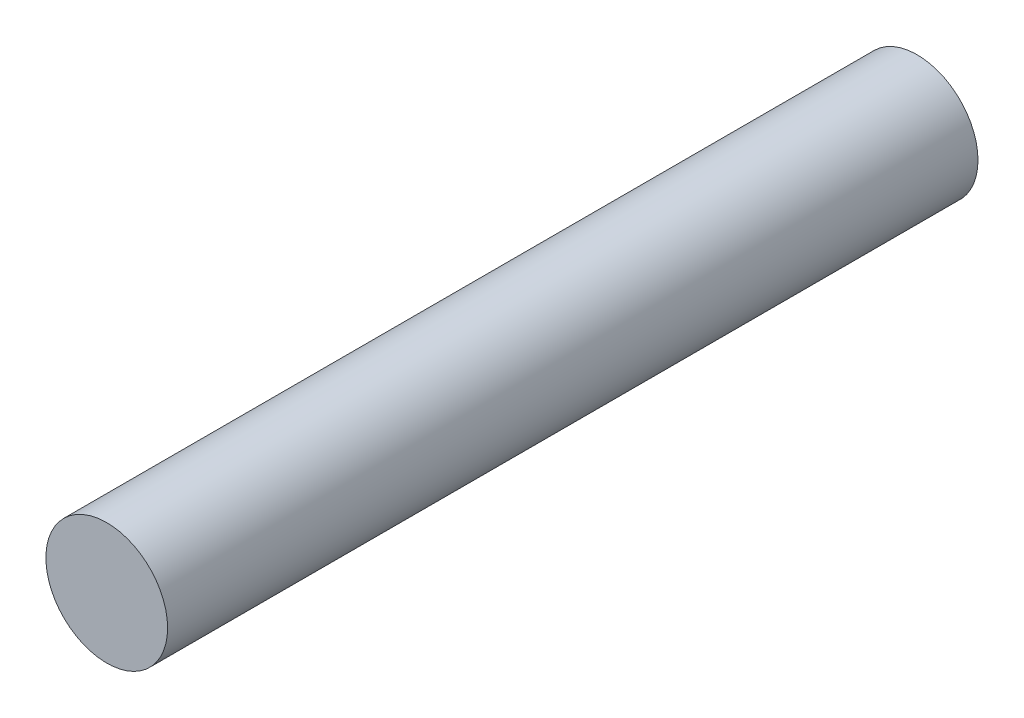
from build123d import *

# Parameters (mm, degrees)
SKETCH1_R           = 38
BOSS_EXTRUDE1_DEPTH = 253


with BuildPart() as part:
    # Sketch1 → Boss-Extrude1 (new, symmetric)
    with BuildSketch(Plane.XY):
        Circle(SKETCH1_R)
    extrude(amount=BOSS_EXTRUDE1_DEPTH, both=True)


solid = part.part
